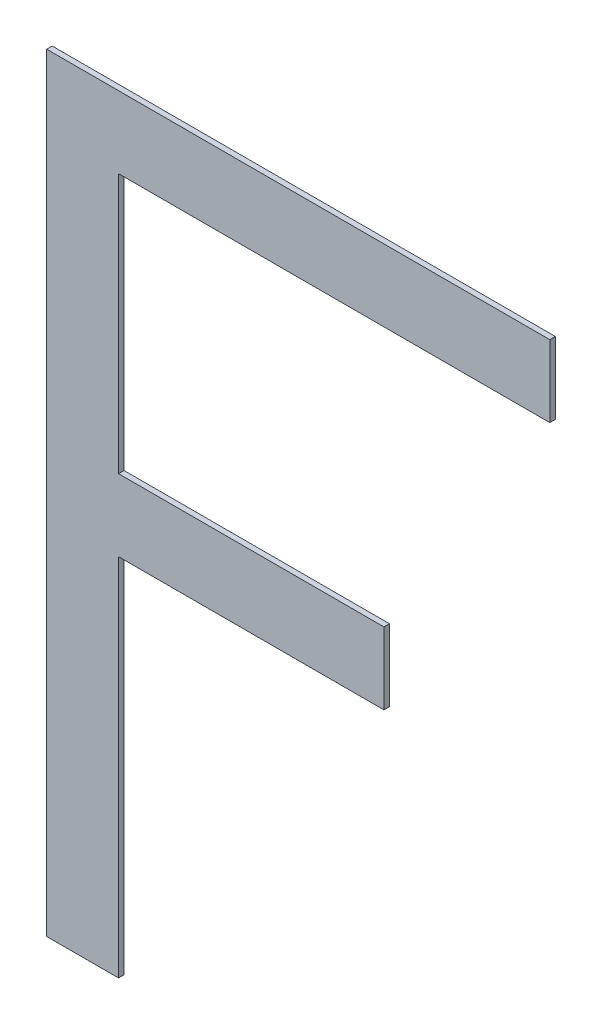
ISO-10303-21;
HEADER;
FILE_DESCRIPTION(('STEP AP214'),'2;1');
FILE_NAME('part.step','',(''),(''),'','','');
FILE_SCHEMA(('AUTOMOTIVE_DESIGN { 1 0 10303 214 1 1 1 1 }'));
ENDSEC;
DATA;
#1=APPLICATION_CONTEXT('core data for automotive mechanical design processes');
#2=APPLICATION_PROTOCOL_DEFINITION('international standard','automotive_design',2000,#1);
#3=PRODUCT_CONTEXT('',#1,'mechanical');
#4=PRODUCT('Part','Part','',(#3));
#5=PRODUCT_RELATED_PRODUCT_CATEGORY('part','',(#4));
#6=PRODUCT_DEFINITION_FORMATION('','',#4);
#7=PRODUCT_DEFINITION_CONTEXT('part definition',#1,'design');
#8=PRODUCT_DEFINITION('design','',#6,#7);
#9=PRODUCT_DEFINITION_SHAPE('','',#8);
#10=(LENGTH_UNIT() NAMED_UNIT(*) SI_UNIT(.MILLI.,.METRE.));
#11=(NAMED_UNIT(*) PLANE_ANGLE_UNIT() SI_UNIT($,.RADIAN.));
#12=(NAMED_UNIT(*) SI_UNIT($,.STERADIAN.) SOLID_ANGLE_UNIT());
#13=UNCERTAINTY_MEASURE_WITH_UNIT(LENGTH_MEASURE(1.E-05),#10,'distance_accuracy_value','');
#14=(GEOMETRIC_REPRESENTATION_CONTEXT(3) GLOBAL_UNCERTAINTY_ASSIGNED_CONTEXT((#13)) GLOBAL_UNIT_ASSIGNED_CONTEXT((#10,
#11,#12)) REPRESENTATION_CONTEXT('',''));
#15=CARTESIAN_POINT('',(0.,0.,0.));
#16=DIRECTION('',(0.,0.,1.));
#17=DIRECTION('',(1.,0.,0.));
#18=AXIS2_PLACEMENT_3D('',#15,#16,#17);
#19=CARTESIAN_POINT('',(-0.45500036,-0.69499988,0.01));
#20=DIRECTION('',(0.,0.,-1.));
#21=DIRECTION('',(-1.,0.,0.));
#22=AXIS2_PLACEMENT_3D('',#19,#20,#21);
#23=PLANE('',#22);
#24=DIRECTION('',(0.,1.,0.));
#25=VECTOR('',#24,1.);
#26=CARTESIAN_POINT('',(-0.32499808,-0.69499988,0.01));
#27=LINE('',#26,#25);
#28=CARTESIAN_POINT('',(-0.32499808,-0.03500120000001,0.01));
#29=VERTEX_POINT('',#28);
#30=CARTESIAN_POINT('',(-0.32499808,-0.69499988,0.01));
#31=VERTEX_POINT('',#30);
#32=EDGE_CURVE('E117',#29,#31,#27,.F.);
#33=ORIENTED_EDGE('',*,*,#32,.F.);
#34=DIRECTION('',(-1.,0.,0.));
#35=VECTOR('',#34,1.);
#36=CARTESIAN_POINT('',(-0.45500036,-0.03500120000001,0.01));
#37=LINE('',#36,#35);
#38=CARTESIAN_POINT('',(0.15500096,-0.03500120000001,0.01));
#39=VERTEX_POINT('',#38);
#40=EDGE_CURVE('E113',#39,#29,#37,.T.);
#41=ORIENTED_EDGE('',*,*,#40,.F.);
#42=DIRECTION('',(0.,1.,0.));
#43=VECTOR('',#42,1.);
#44=CARTESIAN_POINT('',(0.15500096,-0.69499988,0.01));
#45=LINE('',#44,#43);
#46=CARTESIAN_POINT('',(0.15500096,0.09499853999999,0.01));
#47=VERTEX_POINT('',#46);
#48=EDGE_CURVE('E112',#47,#39,#45,.F.);
#49=ORIENTED_EDGE('',*,*,#48,.F.);
#50=DIRECTION('',(-1.,0.,0.));
#51=VECTOR('',#50,1.);
#52=CARTESIAN_POINT('',(-0.45500036,0.09499853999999,0.01));
#53=LINE('',#52,#51);
#54=CARTESIAN_POINT('',(-0.32499808,0.09499853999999,0.01));
#55=VERTEX_POINT('',#54);
#56=EDGE_CURVE('E91',#55,#47,#53,.F.);
#57=ORIENTED_EDGE('',*,*,#56,.F.);
#58=DIRECTION('',(0.,1.,0.));
#59=VECTOR('',#58,1.);
#60=CARTESIAN_POINT('',(-0.32499808,-0.69499988,0.01));
#61=LINE('',#60,#59);
#62=CARTESIAN_POINT('',(-0.32499808,0.56500014,0.01));
#63=VERTEX_POINT('',#62);
#64=EDGE_CURVE('E20',#63,#55,#61,.F.);
#65=ORIENTED_EDGE('',*,*,#64,.F.);
#66=DIRECTION('',(1.,0.,0.));
#67=VECTOR('',#66,1.);
#68=CARTESIAN_POINT('',(-0.32499808,0.56500014,0.01));
#69=LINE('',#68,#67);
#70=CARTESIAN_POINT('',(0.45500036,0.56500014,0.01));
#71=VERTEX_POINT('',#70);
#72=EDGE_CURVE('E132',#63,#71,#69,.T.);
#73=ORIENTED_EDGE('',*,*,#72,.T.);
#74=DIRECTION('',(0.,1.,0.));
#75=VECTOR('',#74,1.);
#76=CARTESIAN_POINT('',(0.45500036,0.56500014,0.01));
#77=LINE('',#76,#75);
#78=CARTESIAN_POINT('',(0.45500036,0.69499988,0.01));
#79=VERTEX_POINT('',#78);
#80=EDGE_CURVE('E128',#71,#79,#77,.T.);
#81=ORIENTED_EDGE('',*,*,#80,.T.);
#82=DIRECTION('',(1.,0.,0.));
#83=VECTOR('',#82,1.);
#84=CARTESIAN_POINT('',(0.45500036,0.69499988,0.01));
#85=LINE('',#84,#83);
#86=CARTESIAN_POINT('',(-0.45500036,0.69499988,0.01));
#87=VERTEX_POINT('',#86);
#88=EDGE_CURVE('E124',#79,#87,#85,.F.);
#89=ORIENTED_EDGE('',*,*,#88,.T.);
#90=DIRECTION('',(0.,1.,0.));
#91=VECTOR('',#90,1.);
#92=CARTESIAN_POINT('',(-0.45500036,0.69499988,0.01));
#93=LINE('',#92,#91);
#94=CARTESIAN_POINT('',(-0.45500036,-0.69499988,0.01));
#95=VERTEX_POINT('',#94);
#96=EDGE_CURVE('E121',#87,#95,#93,.F.);
#97=ORIENTED_EDGE('',*,*,#96,.T.);
#98=DIRECTION('',(-1.,0.,0.));
#99=VECTOR('',#98,1.);
#100=CARTESIAN_POINT('',(-0.45500036,-0.69499988,0.01));
#101=LINE('',#100,#99);
#102=EDGE_CURVE('E119',#31,#95,#101,.T.);
#103=ORIENTED_EDGE('',*,*,#102,.F.);
#104=EDGE_LOOP('',(#33,#41,#49,#57,#65,#73,#81,#89,#97,#103));
#105=FACE_BOUND('',#104,.T.);
#106=ADVANCED_FACE('F17',(#105),#23,.F.);
#107=CARTESIAN_POINT('',(-0.45500036,0.69499988,0.));
#108=DIRECTION('',(1.,0.,0.));
#109=DIRECTION('',(0.,0.,-1.));
#110=AXIS2_PLACEMENT_3D('',#107,#108,#109);
#111=PLANE('',#110);
#112=DIRECTION('',(0.,0.,1.));
#113=VECTOR('',#112,1.);
#114=CARTESIAN_POINT('',(-0.45500036,-0.69499988,0.));
#115=LINE('',#114,#113);
#116=CARTESIAN_POINT('',(-0.45500036,-0.69499988,0.));
#117=VERTEX_POINT('',#116);
#118=EDGE_CURVE('E142',#117,#95,#115,.T.);
#119=ORIENTED_EDGE('',*,*,#118,.T.);
#120=ORIENTED_EDGE('',*,*,#96,.F.);
#121=DIRECTION('',(0.,0.,-1.));
#122=VECTOR('',#121,1.);
#123=CARTESIAN_POINT('',(-0.45500036,0.69499988,0.));
#124=LINE('',#123,#122);
#125=CARTESIAN_POINT('',(-0.45500036,0.69499988,0.));
#126=VERTEX_POINT('',#125);
#127=EDGE_CURVE('E126',#87,#126,#124,.T.);
#128=ORIENTED_EDGE('',*,*,#127,.T.);
#129=DIRECTION('',(0.,1.,0.));
#130=VECTOR('',#129,1.);
#131=CARTESIAN_POINT('',(-0.45500036,-0.69499988,0.));
#132=LINE('',#131,#130);
#133=EDGE_CURVE('E146',#117,#126,#132,.T.);
#134=ORIENTED_EDGE('',*,*,#133,.F.);
#135=EDGE_LOOP('',(#119,#120,#128,#134));
#136=FACE_BOUND('',#135,.T.);
#137=ADVANCED_FACE('F180',(#136),#111,.F.);
#138=CARTESIAN_POINT('',(0.45500036,0.69499988,0.));
#139=DIRECTION('',(0.,-1.,0.));
#140=DIRECTION('',(0.,0.,-1.));
#141=AXIS2_PLACEMENT_3D('',#138,#139,#140);
#142=PLANE('',#141);
#143=ORIENTED_EDGE('',*,*,#127,.F.);
#144=ORIENTED_EDGE('',*,*,#88,.F.);
#145=DIRECTION('',(0.,0.,1.));
#146=VECTOR('',#145,1.);
#147=CARTESIAN_POINT('',(0.45500036,0.69499988,0.));
#148=LINE('',#147,#146);
#149=CARTESIAN_POINT('',(0.45500036,0.69499988,0.));
#150=VERTEX_POINT('',#149);
#151=EDGE_CURVE('E130',#79,#150,#148,.F.);
#152=ORIENTED_EDGE('',*,*,#151,.T.);
#153=DIRECTION('',(-1.,0.,0.));
#154=VECTOR('',#153,1.);
#155=CARTESIAN_POINT('',(-0.45500036,0.69499988,0.));
#156=LINE('',#155,#154);
#157=EDGE_CURVE('E149',#126,#150,#156,.F.);
#158=ORIENTED_EDGE('',*,*,#157,.F.);
#159=EDGE_LOOP('',(#143,#144,#152,#158));
#160=FACE_BOUND('',#159,.T.);
#161=ADVANCED_FACE('F185',(#160),#142,.F.);
#162=CARTESIAN_POINT('',(0.45500036,0.56500014,0.));
#163=DIRECTION('',(-1.,0.,0.));
#164=DIRECTION('',(0.,0.,1.));
#165=AXIS2_PLACEMENT_3D('',#162,#163,#164);
#166=PLANE('',#165);
#167=ORIENTED_EDGE('',*,*,#151,.F.);
#168=ORIENTED_EDGE('',*,*,#80,.F.);
#169=DIRECTION('',(0.,0.,1.));
#170=VECTOR('',#169,1.);
#171=CARTESIAN_POINT('',(0.45500036,0.56500014,0.));
#172=LINE('',#171,#170);
#173=CARTESIAN_POINT('',(0.45500036,0.56500014,0.));
#174=VERTEX_POINT('',#173);
#175=EDGE_CURVE('E134',#71,#174,#172,.F.);
#176=ORIENTED_EDGE('',*,*,#175,.T.);
#177=DIRECTION('',(0.,1.,0.));
#178=VECTOR('',#177,1.);
#179=CARTESIAN_POINT('',(0.45500036,-0.69499988,0.));
#180=LINE('',#179,#178);
#181=EDGE_CURVE('E152',#150,#174,#180,.F.);
#182=ORIENTED_EDGE('',*,*,#181,.F.);
#183=EDGE_LOOP('',(#167,#168,#176,#182));
#184=FACE_BOUND('',#183,.T.);
#185=ADVANCED_FACE('F190',(#184),#166,.F.);
#186=CARTESIAN_POINT('',(-0.32499808,0.56500014,0.));
#187=DIRECTION('',(0.,1.,0.));
#188=DIRECTION('',(0.,0.,1.));
#189=AXIS2_PLACEMENT_3D('',#186,#187,#188);
#190=PLANE('',#189);
#191=ORIENTED_EDGE('',*,*,#175,.F.);
#192=ORIENTED_EDGE('',*,*,#72,.F.);
#193=DIRECTION('',(0.,0.,1.));
#194=VECTOR('',#193,1.);
#195=CARTESIAN_POINT('',(-0.32499808,0.56500014,0.));
#196=LINE('',#195,#194);
#197=CARTESIAN_POINT('',(-0.32499808,0.56500014,0.));
#198=VERTEX_POINT('',#197);
#199=EDGE_CURVE('E100',#63,#198,#196,.F.);
#200=ORIENTED_EDGE('',*,*,#199,.T.);
#201=DIRECTION('',(-1.,0.,0.));
#202=VECTOR('',#201,1.);
#203=CARTESIAN_POINT('',(-0.45500036,0.56500014,0.));
#204=LINE('',#203,#202);
#205=EDGE_CURVE('E155',#174,#198,#204,.T.);
#206=ORIENTED_EDGE('',*,*,#205,.F.);
#207=EDGE_LOOP('',(#191,#192,#200,#206));
#208=FACE_BOUND('',#207,.T.);
#209=ADVANCED_FACE('F194',(#208),#190,.F.);
#210=CARTESIAN_POINT('',(-0.32499808,0.09499853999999,0.));
#211=DIRECTION('',(-1.,0.,0.));
#212=DIRECTION('',(0.,0.,1.));
#213=AXIS2_PLACEMENT_3D('',#210,#211,#212);
#214=PLANE('',#213);
#215=ORIENTED_EDGE('',*,*,#199,.F.);
#216=ORIENTED_EDGE('',*,*,#64,.T.);
#217=DIRECTION('',(0.,0.,-1.));
#218=VECTOR('',#217,1.);
#219=CARTESIAN_POINT('',(-0.32499808,0.09499853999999,0.));
#220=LINE('',#219,#218);
#221=CARTESIAN_POINT('',(-0.32499808,0.09499853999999,0.));
#222=VERTEX_POINT('',#221);
#223=EDGE_CURVE('E98',#55,#222,#220,.T.);
#224=ORIENTED_EDGE('',*,*,#223,.T.);
#225=DIRECTION('',(0.,1.,0.));
#226=VECTOR('',#225,1.);
#227=CARTESIAN_POINT('',(-0.32499808,-0.69499988,0.));
#228=LINE('',#227,#226);
#229=EDGE_CURVE('E158',#198,#222,#228,.F.);
#230=ORIENTED_EDGE('',*,*,#229,.F.);
#231=EDGE_LOOP('',(#215,#216,#224,#230));
#232=FACE_BOUND('',#231,.T.);
#233=ADVANCED_FACE('F96',(#232),#214,.F.);
#234=CARTESIAN_POINT('',(0.15500096,0.09499853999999,0.));
#235=DIRECTION('',(0.,-1.,0.));
#236=DIRECTION('',(0.,0.,-1.));
#237=AXIS2_PLACEMENT_3D('',#234,#235,#236);
#238=PLANE('',#237);
#239=ORIENTED_EDGE('',*,*,#223,.F.);
#240=ORIENTED_EDGE('',*,*,#56,.T.);
#241=DIRECTION('',(0.,0.,1.));
#242=VECTOR('',#241,1.);
#243=CARTESIAN_POINT('',(0.15500096,0.09499853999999,0.));
#244=LINE('',#243,#242);
#245=CARTESIAN_POINT('',(0.15500096,0.09499853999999,0.));
#246=VERTEX_POINT('',#245);
#247=EDGE_CURVE('E107',#47,#246,#244,.F.);
#248=ORIENTED_EDGE('',*,*,#247,.T.);
#249=DIRECTION('',(-1.,0.,0.));
#250=VECTOR('',#249,1.);
#251=CARTESIAN_POINT('',(-0.45500036,0.09499853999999,0.));
#252=LINE('',#251,#250);
#253=EDGE_CURVE('E105',#222,#246,#252,.F.);
#254=ORIENTED_EDGE('',*,*,#253,.F.);
#255=EDGE_LOOP('',(#239,#240,#248,#254));
#256=FACE_BOUND('',#255,.T.);
#257=ADVANCED_FACE('F103',(#256),#238,.F.);
#258=CARTESIAN_POINT('',(0.15500096,-0.03500120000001,0.));
#259=DIRECTION('',(-1.,0.,0.));
#260=DIRECTION('',(0.,0.,1.));
#261=AXIS2_PLACEMENT_3D('',#258,#259,#260);
#262=PLANE('',#261);
#263=ORIENTED_EDGE('',*,*,#247,.F.);
#264=ORIENTED_EDGE('',*,*,#48,.T.);
#265=DIRECTION('',(0.,0.,1.));
#266=VECTOR('',#265,1.);
#267=CARTESIAN_POINT('',(0.15500096,-0.03500120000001,0.));
#268=LINE('',#267,#266);
#269=CARTESIAN_POINT('',(0.15500096,-0.03500120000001,0.));
#270=VERTEX_POINT('',#269);
#271=EDGE_CURVE('E138',#39,#270,#268,.F.);
#272=ORIENTED_EDGE('',*,*,#271,.T.);
#273=DIRECTION('',(0.,1.,0.));
#274=VECTOR('',#273,1.);
#275=CARTESIAN_POINT('',(0.15500096,-0.69499988,0.));
#276=LINE('',#275,#274);
#277=EDGE_CURVE('E161',#246,#270,#276,.F.);
#278=ORIENTED_EDGE('',*,*,#277,.F.);
#279=EDGE_LOOP('',(#263,#264,#272,#278));
#280=FACE_BOUND('',#279,.T.);
#281=ADVANCED_FACE('F197',(#280),#262,.F.);
#282=CARTESIAN_POINT('',(-0.32499808,-0.03500120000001,0.));
#283=DIRECTION('',(0.,1.,0.));
#284=DIRECTION('',(0.,0.,1.));
#285=AXIS2_PLACEMENT_3D('',#282,#283,#284);
#286=PLANE('',#285);
#287=ORIENTED_EDGE('',*,*,#271,.F.);
#288=ORIENTED_EDGE('',*,*,#40,.T.);
#289=DIRECTION('',(0.,0.,1.));
#290=VECTOR('',#289,1.);
#291=CARTESIAN_POINT('',(-0.32499808,-0.03500120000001,0.));
#292=LINE('',#291,#290);
#293=CARTESIAN_POINT('',(-0.32499808,-0.03500120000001,0.));
#294=VERTEX_POINT('',#293);
#295=EDGE_CURVE('E140',#29,#294,#292,.F.);
#296=ORIENTED_EDGE('',*,*,#295,.T.);
#297=DIRECTION('',(-1.,0.,0.));
#298=VECTOR('',#297,1.);
#299=CARTESIAN_POINT('',(-0.45500036,-0.03500120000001,0.));
#300=LINE('',#299,#298);
#301=EDGE_CURVE('E164',#270,#294,#300,.T.);
#302=ORIENTED_EDGE('',*,*,#301,.F.);
#303=EDGE_LOOP('',(#287,#288,#296,#302));
#304=FACE_BOUND('',#303,.T.);
#305=ADVANCED_FACE('F199',(#304),#286,.F.);
#306=CARTESIAN_POINT('',(-0.32499808,-0.69499988,0.));
#307=DIRECTION('',(-1.,0.,0.));
#308=DIRECTION('',(0.,0.,1.));
#309=AXIS2_PLACEMENT_3D('',#306,#307,#308);
#310=PLANE('',#309);
#311=ORIENTED_EDGE('',*,*,#295,.F.);
#312=ORIENTED_EDGE('',*,*,#32,.T.);
#313=DIRECTION('',(0.,0.,1.));
#314=VECTOR('',#313,1.);
#315=CARTESIAN_POINT('',(-0.32499808,-0.69499988,0.));
#316=LINE('',#315,#314);
#317=CARTESIAN_POINT('',(-0.32499808,-0.69499988,0.));
#318=VERTEX_POINT('',#317);
#319=EDGE_CURVE('E35',#31,#318,#316,.F.);
#320=ORIENTED_EDGE('',*,*,#319,.T.);
#321=DIRECTION('',(0.,1.,0.));
#322=VECTOR('',#321,1.);
#323=CARTESIAN_POINT('',(-0.32499808,-0.69499988,0.));
#324=LINE('',#323,#322);
#325=EDGE_CURVE('E26',#294,#318,#324,.F.);
#326=ORIENTED_EDGE('',*,*,#325,.F.);
#327=EDGE_LOOP('',(#311,#312,#320,#326));
#328=FACE_BOUND('',#327,.T.);
#329=ADVANCED_FACE('F172',(#328),#310,.F.);
#330=CARTESIAN_POINT('',(-0.45500036,-0.69499988,0.));
#331=DIRECTION('',(0.,1.,0.));
#332=DIRECTION('',(0.,0.,1.));
#333=AXIS2_PLACEMENT_3D('',#330,#331,#332);
#334=PLANE('',#333);
#335=ORIENTED_EDGE('',*,*,#319,.F.);
#336=ORIENTED_EDGE('',*,*,#102,.T.);
#337=ORIENTED_EDGE('',*,*,#118,.F.);
#338=DIRECTION('',(-1.,0.,0.));
#339=VECTOR('',#338,1.);
#340=CARTESIAN_POINT('',(-0.45500036,-0.69499988,0.));
#341=LINE('',#340,#339);
#342=EDGE_CURVE('E11',#318,#117,#341,.T.);
#343=ORIENTED_EDGE('',*,*,#342,.F.);
#344=EDGE_LOOP('',(#335,#336,#337,#343));
#345=FACE_BOUND('',#344,.T.);
#346=ADVANCED_FACE('F178',(#345),#334,.F.);
#347=CARTESIAN_POINT('',(-0.45500036,-0.69499988,0.));
#348=DIRECTION('',(0.,0.,-1.));
#349=DIRECTION('',(-1.,0.,0.));
#350=AXIS2_PLACEMENT_3D('',#347,#348,#349);
#351=PLANE('',#350);
#352=ORIENTED_EDGE('',*,*,#325,.T.);
#353=ORIENTED_EDGE('',*,*,#342,.T.);
#354=ORIENTED_EDGE('',*,*,#133,.T.);
#355=ORIENTED_EDGE('',*,*,#157,.T.);
#356=ORIENTED_EDGE('',*,*,#181,.T.);
#357=ORIENTED_EDGE('',*,*,#205,.T.);
#358=ORIENTED_EDGE('',*,*,#229,.T.);
#359=ORIENTED_EDGE('',*,*,#253,.T.);
#360=ORIENTED_EDGE('',*,*,#277,.T.);
#361=ORIENTED_EDGE('',*,*,#301,.T.);
#362=EDGE_LOOP('',(#352,#353,#354,#355,#356,#357,#358,#359,#360,#361));
#363=FACE_BOUND('',#362,.T.);
#364=ADVANCED_FACE('F169',(#363),#351,.T.);
#365=CLOSED_SHELL('',(#106,#137,#161,#185,#209,#233,#257,#281,#305,#329,#346,#364));
#366=MANIFOLD_SOLID_BREP('B1',#365);
#367=ADVANCED_BREP_SHAPE_REPRESENTATION('',(#18,#366),#14);
#368=SHAPE_DEFINITION_REPRESENTATION(#9,#367);
ENDSEC;
END-ISO-10303-21;
